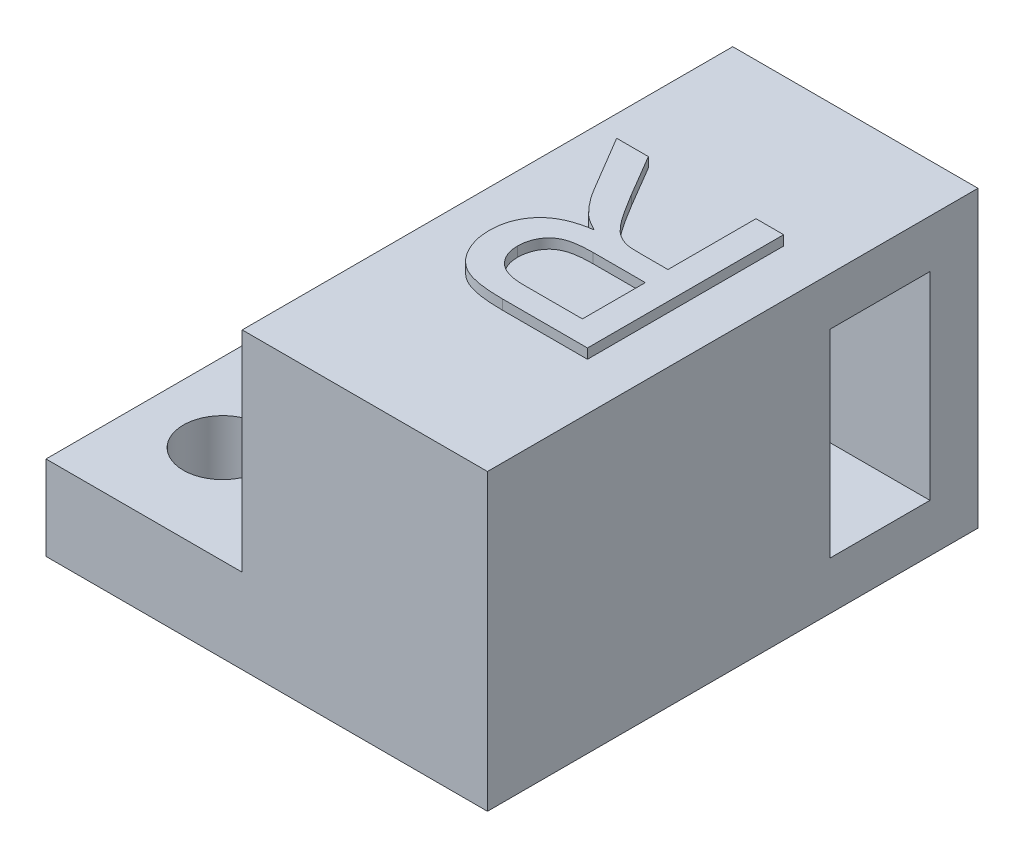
ISO-10303-21;
HEADER;
FILE_DESCRIPTION(('STEP AP214'),'2;1');
FILE_NAME('part.step','',(''),(''),'','','');
FILE_SCHEMA(('AUTOMOTIVE_DESIGN { 1 0 10303 214 1 1 1 1 }'));
ENDSEC;
DATA;
#1=APPLICATION_CONTEXT('core data for automotive mechanical design processes');
#2=APPLICATION_PROTOCOL_DEFINITION('international standard','automotive_design',2000,#1);
#3=PRODUCT_CONTEXT('',#1,'mechanical');
#4=PRODUCT('Part','Part','',(#3));
#5=PRODUCT_RELATED_PRODUCT_CATEGORY('part','',(#4));
#6=PRODUCT_DEFINITION_FORMATION('','',#4);
#7=PRODUCT_DEFINITION_CONTEXT('part definition',#1,'design');
#8=PRODUCT_DEFINITION('design','',#6,#7);
#9=PRODUCT_DEFINITION_SHAPE('','',#8);
#10=(LENGTH_UNIT() NAMED_UNIT(*) SI_UNIT(.MILLI.,.METRE.));
#11=(NAMED_UNIT(*) PLANE_ANGLE_UNIT() SI_UNIT($,.RADIAN.));
#12=(NAMED_UNIT(*) SI_UNIT($,.STERADIAN.) SOLID_ANGLE_UNIT());
#13=UNCERTAINTY_MEASURE_WITH_UNIT(LENGTH_MEASURE(1.E-05),#10,'distance_accuracy_value','');
#14=(GEOMETRIC_REPRESENTATION_CONTEXT(3) GLOBAL_UNCERTAINTY_ASSIGNED_CONTEXT((#13)) GLOBAL_UNIT_ASSIGNED_CONTEXT((#10,
#11,#12)) REPRESENTATION_CONTEXT('',''));
#15=CARTESIAN_POINT('',(0.,0.,0.));
#16=DIRECTION('',(0.,0.,1.));
#17=DIRECTION('',(1.,0.,0.));
#18=AXIS2_PLACEMENT_3D('',#15,#16,#17);
#19=CARTESIAN_POINT('',(0.,30.,0.));
#20=DIRECTION('',(0.,1.,0.));
#21=DIRECTION('',(0.,0.,1.));
#22=AXIS2_PLACEMENT_3D('',#19,#20,#21);
#23=PLANE('',#22);
#24=DIRECTION('',(1.,0.,0.));
#25=VECTOR('',#24,1.);
#26=CARTESIAN_POINT('',(4.87179487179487,30.,-9.99999999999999));
#27=LINE('',#26,#25);
#28=CARTESIAN_POINT('',(4.87179487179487,30.,-9.99999999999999));
#29=VERTEX_POINT('',#28);
#30=CARTESIAN_POINT('',(7.69230769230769,30.,-9.99999999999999));
#31=VERTEX_POINT('',#30);
#32=EDGE_CURVE('E245',#29,#31,#27,.T.);
#33=ORIENTED_EDGE('',*,*,#32,.T.);
#34=DIRECTION('',(0.,0.,1.));
#35=VECTOR('',#34,1.);
#36=CARTESIAN_POINT('',(7.69230769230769,30.,-9.99999999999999));
#37=LINE('',#36,#35);
#38=CARTESIAN_POINT('',(7.69230769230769,30.,10.));
#39=VERTEX_POINT('',#38);
#40=EDGE_CURVE('E322',#31,#39,#37,.T.);
#41=ORIENTED_EDGE('',*,*,#40,.T.);
#42=DIRECTION('',(-1.,0.,0.));
#43=VECTOR('',#42,1.);
#44=CARTESIAN_POINT('',(7.69230769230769,30.,10.));
#45=LINE('',#44,#43);
#46=CARTESIAN_POINT('',(-0.985576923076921,30.,10.));
#47=VERTEX_POINT('',#46);
#48=EDGE_CURVE('E324',#39,#47,#45,.T.);
#49=ORIENTED_EDGE('',*,*,#48,.T.);
#50=CARTESIAN_POINT('',(-0.985576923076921,30.,10.));
#51=CARTESIAN_POINT('',(-1.18991550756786,30.,9.99840651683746));
#52=CARTESIAN_POINT('',(-1.5853889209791,30.,9.99532251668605));
#53=CARTESIAN_POINT('',(-2.15889116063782,30.,9.97328498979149));
#54=CARTESIAN_POINT('',(-2.6929331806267,30.,9.92646624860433));
#55=CARTESIAN_POINT('',(-3.19088074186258,30.,9.87417544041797));
#56=CARTESIAN_POINT('',(-3.65188178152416,30.,9.79696704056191));
#57=CARTESIAN_POINT('',(-4.07615600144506,30.,9.70638766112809));
#58=CARTESIAN_POINT('',(-4.46207621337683,30.,9.59933336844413));
#59=CARTESIAN_POINT('',(-4.81257884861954,30.,9.47279075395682));
#60=CARTESIAN_POINT('',(-5.13779529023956,30.,9.32967365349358));
#61=CARTESIAN_POINT('',(-5.43916057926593,30.,9.15299269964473));
#62=CARTESIAN_POINT('',(-5.7296147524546,30.,8.95972151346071));
#63=CARTESIAN_POINT('',(-5.99757966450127,30.,8.73076560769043));
#64=CARTESIAN_POINT('',(-6.25512436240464,30.,8.48477723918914));
#65=CARTESIAN_POINT('',(-6.49146620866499,30.,8.20944831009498));
#66=CARTESIAN_POINT('',(-6.71359972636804,30.,7.91167004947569));
#67=CARTESIAN_POINT('',(-6.98368473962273,30.,7.48045766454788));
#68=CARTESIAN_POINT('',(-7.26734753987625,30.,6.90244818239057));
#69=CARTESIAN_POINT('',(-7.51167111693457,30.,6.16809301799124));
#70=CARTESIAN_POINT('',(-7.66702865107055,30.,5.39913497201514));
#71=CARTESIAN_POINT('',(-7.68379893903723,30.,4.87387389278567));
#72=CARTESIAN_POINT('',(-7.69230769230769,30.,4.6073717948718));
#73=B_SPLINE_CURVE_WITH_KNOTS('',3,(#50,#51,#52,#53,#54,#55,#56,#57,#58,#59,#60,#61,#62,#63,#64,
#65,#66,#67,#68,#69,#70,#71,#72),.UNSPECIFIED.,.F.,.F.,(4,1,1,1,1,1,1,1,1,1,1,1,1,1,1,1,1,1,1,1,
4),(0.,0.0621037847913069,0.12019460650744,0.174359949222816,0.225007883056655,
0.272315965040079,0.316339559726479,0.356815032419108,0.393918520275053,0.429524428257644,
0.464613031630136,0.4999612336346,0.535402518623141,0.571568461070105,0.608108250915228,
0.645530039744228,0.684379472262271,0.762612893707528,0.840520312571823,0.919084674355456,1.),.UNSPECIFIED.);
#74=CARTESIAN_POINT('',(-7.69230769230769,30.,4.6073717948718));
#75=VERTEX_POINT('',#74);
#76=EDGE_CURVE('E326',#47,#75,#73,.T.);
#77=ORIENTED_EDGE('',*,*,#76,.T.);
#78=CARTESIAN_POINT('',(-7.69230769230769,30.,4.6073717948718));
#79=CARTESIAN_POINT('',(-7.68839401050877,30.,4.43628861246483));
#80=CARTESIAN_POINT('',(-7.6806642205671,30.,4.0983875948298));
#81=CARTESIAN_POINT('',(-7.62145411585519,30.,3.60158210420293));
#82=CARTESIAN_POINT('',(-7.51431592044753,30.,3.12690653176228));
#83=CARTESIAN_POINT('',(-7.37693981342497,30.,2.67019394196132));
#84=CARTESIAN_POINT('',(-7.1888858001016,30.,2.23795101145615));
#85=CARTESIAN_POINT('',(-6.97113295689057,30.,1.82121588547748));
#86=CARTESIAN_POINT('',(-6.70098761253,30.,1.43193283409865));
#87=CARTESIAN_POINT('',(-6.39935585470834,30.,1.05709163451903));
#88=CARTESIAN_POINT('',(-6.04861271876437,30.,0.713608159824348));
#89=CARTESIAN_POINT('',(-5.65846741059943,30.,0.396146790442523));
#90=CARTESIAN_POINT('',(-5.21719058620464,30.,0.123711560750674));
#91=CARTESIAN_POINT('',(-4.73925532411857,30.,-0.129469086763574));
#92=CARTESIAN_POINT('',(-4.21234446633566,30.,-0.337396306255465));
#93=CARTESIAN_POINT('',(-3.64440433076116,30.,-0.52048296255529));
#94=CARTESIAN_POINT('',(-3.03103937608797,30.,-0.66164794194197));
#95=CARTESIAN_POINT('',(-2.60590699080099,30.,-0.73275428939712));
#96=CARTESIAN_POINT('',(-2.38782051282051,30.,-0.769230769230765));
#97=B_SPLINE_CURVE_WITH_KNOTS('',3,(#78,#79,#80,#81,#82,#83,#84,#85,#86,#87,#88,#89,#90,#91,#92,
#93,#94,#95,#96),.UNSPECIFIED.,.F.,.F.,(4,1,1,1,1,1,1,1,1,1,1,1,1,1,1,1,4),(0.,
0.0614153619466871,0.121299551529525,0.17923073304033,0.235946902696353,0.292227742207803,
0.348209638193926,0.404459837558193,0.462042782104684,0.520693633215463,0.580370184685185,
0.642220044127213,0.706552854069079,0.77430530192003,0.84526593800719,0.920623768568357,1.),.UNSPECIFIED.);
#98=CARTESIAN_POINT('',(-2.38782051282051,30.,-0.769230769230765));
#99=VERTEX_POINT('',#98);
#100=EDGE_CURVE('E330',#75,#99,#97,.T.);
#101=ORIENTED_EDGE('',*,*,#100,.T.);
#102=CARTESIAN_POINT('',(-2.38782051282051,30.,-0.769230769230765));
#103=CARTESIAN_POINT('',(-2.5493459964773,30.,-0.849743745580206));
#104=CARTESIAN_POINT('',(-2.85566462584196,30.,-1.00242940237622));
#105=CARTESIAN_POINT('',(-3.27249870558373,30.,-1.25505902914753));
#106=CARTESIAN_POINT('',(-3.63766389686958,30.,-1.49288820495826));
#107=CARTESIAN_POINT('',(-3.84509280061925,30.,-1.67122655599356));
#108=CARTESIAN_POINT('',(-3.94230769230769,30.,-1.75480769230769));
#109=B_SPLINE_CURVE_WITH_KNOTS('',3,(#102,#103,#104,#105,#106,#107,#108),.UNSPECIFIED.,.F.,.F.,
(4,1,1,1,4),(0.,0.293137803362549,0.555909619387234,0.791869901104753,1.),.UNSPECIFIED.);
#110=CARTESIAN_POINT('',(-3.94230769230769,30.,-1.75480769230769));
#111=VERTEX_POINT('',#110);
#112=EDGE_CURVE('E337',#99,#111,#109,.T.);
#113=ORIENTED_EDGE('',*,*,#112,.T.);
#114=CARTESIAN_POINT('',(-3.94230769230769,30.,-1.75480769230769));
#115=CARTESIAN_POINT('',(-4.13156095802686,30.,-1.93976087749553));
#116=CARTESIAN_POINT('',(-4.51968824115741,30.,-2.31906940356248));
#117=CARTESIAN_POINT('',(-5.04933861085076,30.,-2.97113456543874));
#118=CARTESIAN_POINT('',(-5.57342133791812,30.,-3.68821961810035));
#119=CARTESIAN_POINT('',(-5.88806966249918,30.,-4.21077269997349));
#120=CARTESIAN_POINT('',(-6.04967948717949,30.,-4.47916666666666));
#121=B_SPLINE_CURVE_WITH_KNOTS('',3,(#114,#115,#116,#117,#118,#119,#120),.UNSPECIFIED.,.F.,.F.,
(4,1,1,1,4),(0.,0.229542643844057,0.470754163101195,0.728168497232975,1.),.UNSPECIFIED.);
#122=CARTESIAN_POINT('',(-6.04967948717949,30.,-4.47916666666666));
#123=VERTEX_POINT('',#122);
#124=EDGE_CURVE('E344',#111,#123,#121,.T.);
#125=ORIENTED_EDGE('',*,*,#124,.T.);
#126=DIRECTION('',(-0.510913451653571,0.,-0.859632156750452));
#127=VECTOR('',#126,1.);
#128=CARTESIAN_POINT('',(-6.04967948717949,30.,-4.47916666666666));
#129=LINE('',#128,#127);
#130=CARTESIAN_POINT('',(-9.33092948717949,30.,-9.99999999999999));
#131=VERTEX_POINT('',#130);
#132=EDGE_CURVE('E351',#123,#131,#129,.T.);
#133=ORIENTED_EDGE('',*,*,#132,.T.);
#134=DIRECTION('',(1.,0.,0.));
#135=VECTOR('',#134,1.);
#136=CARTESIAN_POINT('',(-9.33092948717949,30.,-9.99999999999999));
#137=LINE('',#136,#135);
#138=CARTESIAN_POINT('',(-6.09775641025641,30.,-9.99999999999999));
#139=VERTEX_POINT('',#138);
#140=EDGE_CURVE('E356',#131,#139,#137,.T.);
#141=ORIENTED_EDGE('',*,*,#140,.T.);
#142=DIRECTION('',(0.508233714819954,0.,0.861219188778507));
#143=VECTOR('',#142,1.);
#144=CARTESIAN_POINT('',(-6.09775641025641,30.,-9.99999999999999));
#145=LINE('',#144,#143);
#146=CARTESIAN_POINT('',(-3.60576923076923,30.,-5.77724358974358));
#147=VERTEX_POINT('',#146);
#148=EDGE_CURVE('E358',#139,#147,#145,.T.);
#149=ORIENTED_EDGE('',*,*,#148,.T.);
#150=CARTESIAN_POINT('',(-3.60576923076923,30.,-5.77724358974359));
#151=CARTESIAN_POINT('',(-3.51616440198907,30.,-5.62908678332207));
#152=CARTESIAN_POINT('',(-3.34252495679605,30.,-5.34198321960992));
#153=CARTESIAN_POINT('',(-3.09179888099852,30.,-4.92262192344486));
#154=CARTESIAN_POINT('',(-2.84563940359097,30.,-4.53675178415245));
#155=CARTESIAN_POINT('',(-2.61844005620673,30.,-4.17236063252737));
#156=CARTESIAN_POINT('',(-2.39579219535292,30.,-3.83905820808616));
#157=CARTESIAN_POINT('',(-2.19620328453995,30.,-3.52423053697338));
#158=CARTESIAN_POINT('',(-1.99576395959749,30.,-3.24571275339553));
#159=CARTESIAN_POINT('',(-1.7656151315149,30.,-2.91110532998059));
#160=CARTESIAN_POINT('',(-1.48454603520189,30.,-2.54933418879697));
#161=CARTESIAN_POINT('',(-1.15655827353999,30.,-2.1776900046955));
#162=CARTESIAN_POINT('',(-0.854995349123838,30.,-1.8698364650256));
#163=CARTESIAN_POINT('',(-0.473923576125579,30.,-1.5761032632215));
#164=CARTESIAN_POINT('',(-8.08077984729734E-05,30.,-1.30716183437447));
#165=CARTESIAN_POINT('',(0.399436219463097,30.,-1.17958321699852));
#166=CARTESIAN_POINT('',(0.592948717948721,30.,-1.11778846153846));
#167=B_SPLINE_CURVE_WITH_KNOTS('',3,(#150,#151,#152,#153,#154,#155,#156,#157,#158,#159,#160,
#161,#162,#163,#164,#165,#166),.UNSPECIFIED.,.F.,.F.,(4,1,1,1,1,1,1,1,1,1,1,1,1,1,4),(0.,
0.0807565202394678,0.156492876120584,0.227864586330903,0.294219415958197,0.356757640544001,
0.414804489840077,0.468025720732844,0.516756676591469,0.604217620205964,0.681445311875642,
0.747951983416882,0.804765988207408,0.905435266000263,1.),.UNSPECIFIED.);
#168=CARTESIAN_POINT('',(0.592948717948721,30.,-1.11778846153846));
#169=VERTEX_POINT('',#168);
#170=EDGE_CURVE('E360',#147,#169,#167,.T.);
#171=ORIENTED_EDGE('',*,*,#170,.T.);
#172=CARTESIAN_POINT('',(0.592948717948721,30.,-1.11778846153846));
#173=CARTESIAN_POINT('',(0.674242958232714,30.,-1.10312834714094));
#174=CARTESIAN_POINT('',(0.859840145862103,30.,-1.06965886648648));
#175=CARTESIAN_POINT('',(1.17498370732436,30.,-1.04779989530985));
#176=CARTESIAN_POINT('',(1.5568187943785,30.,-1.02459952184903));
#177=CARTESIAN_POINT('',(1.83354118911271,30.,-1.02527550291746));
#178=CARTESIAN_POINT('',(1.98317307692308,30.,-1.02564102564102));
#179=B_SPLINE_CURVE_WITH_KNOTS('',3,(#172,#173,#174,#175,#176,#177,#178),.UNSPECIFIED.,.F.,.F.,
(4,1,1,1,4),(0.,0.177494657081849,0.405225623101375,0.678388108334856,1.),.UNSPECIFIED.);
#180=CARTESIAN_POINT('',(1.98317307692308,30.,-1.02564102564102));
#181=VERTEX_POINT('',#180);
#182=EDGE_CURVE('E364',#169,#181,#179,.T.);
#183=ORIENTED_EDGE('',*,*,#182,.T.);
#184=DIRECTION('',(1.,0.,0.));
#185=VECTOR('',#184,1.);
#186=CARTESIAN_POINT('',(1.98317307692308,30.,-1.02564102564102));
#187=LINE('',#186,#185);
#188=CARTESIAN_POINT('',(4.87179487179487,30.,-1.02564102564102));
#189=VERTEX_POINT('',#188);
#190=EDGE_CURVE('E55',#181,#189,#187,.T.);
#191=ORIENTED_EDGE('',*,*,#190,.T.);
#192=DIRECTION('',(0.,0.,-1.));
#193=VECTOR('',#192,1.);
#194=CARTESIAN_POINT('',(4.87179487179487,30.,-1.02564102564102));
#195=LINE('',#194,#193);
#196=EDGE_CURVE('E50',#189,#29,#195,.T.);
#197=ORIENTED_EDGE('',*,*,#196,.T.);
#198=EDGE_LOOP('',(#33,#41,#49,#77,#101,#113,#125,#133,#141,#149,#171,#183,#191,#197));
#199=FACE_BOUND('',#198,.T.);
#200=DIRECTION('',(0.,0.,1.));
#201=VECTOR('',#200,1.);
#202=CARTESIAN_POINT('',(-12.5,30.,25.));
#203=LINE('',#202,#201);
#204=CARTESIAN_POINT('',(-12.5,30.,-25.));
#205=VERTEX_POINT('',#204);
#206=CARTESIAN_POINT('',(-12.5,30.,25.));
#207=VERTEX_POINT('',#206);
#208=EDGE_CURVE('E480',#205,#207,#203,.T.);
#209=ORIENTED_EDGE('',*,*,#208,.T.);
#210=DIRECTION('',(1.,0.,0.));
#211=VECTOR('',#210,1.);
#212=CARTESIAN_POINT('',(12.5,30.,25.));
#213=LINE('',#212,#211);
#214=CARTESIAN_POINT('',(12.5,30.,25.));
#215=VERTEX_POINT('',#214);
#216=EDGE_CURVE('E483',#207,#215,#213,.T.);
#217=ORIENTED_EDGE('',*,*,#216,.T.);
#218=DIRECTION('',(0.,0.,-1.));
#219=VECTOR('',#218,1.);
#220=CARTESIAN_POINT('',(12.5,30.,25.));
#221=LINE('',#220,#219);
#222=CARTESIAN_POINT('',(12.5,30.,-25.));
#223=VERTEX_POINT('',#222);
#224=EDGE_CURVE('E486',#215,#223,#221,.T.);
#225=ORIENTED_EDGE('',*,*,#224,.T.);
#226=DIRECTION('',(-1.,0.,0.));
#227=VECTOR('',#226,1.);
#228=CARTESIAN_POINT('',(12.5,30.,-25.));
#229=LINE('',#228,#227);
#230=EDGE_CURVE('E488',#223,#205,#229,.T.);
#231=ORIENTED_EDGE('',*,*,#230,.T.);
#232=EDGE_LOOP('',(#209,#217,#225,#231));
#233=FACE_BOUND('',#232,.T.);
#234=ADVANCED_FACE('F35',(#199,#233),#23,.T.);
#235=CARTESIAN_POINT('',(-12.5,30.,25.));
#236=DIRECTION('',(1.,0.,0.));
#237=DIRECTION('',(0.,0.,-1.));
#238=AXIS2_PLACEMENT_3D('',#235,#236,#237);
#239=PLANE('',#238);
#240=DIRECTION('',(0.,0.,-1.));
#241=VECTOR('',#240,1.);
#242=CARTESIAN_POINT('',(-12.5,8.6050367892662,25.));
#243=LINE('',#242,#241);
#244=CARTESIAN_POINT('',(-12.5,8.6050367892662,25.));
#245=VERTEX_POINT('',#244);
#246=CARTESIAN_POINT('',(-12.5,8.6050367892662,-25.));
#247=VERTEX_POINT('',#246);
#248=EDGE_CURVE('E458',#245,#247,#243,.T.);
#249=ORIENTED_EDGE('',*,*,#248,.F.);
#250=DIRECTION('',(0.,-1.,0.));
#251=VECTOR('',#250,1.);
#252=CARTESIAN_POINT('',(-12.5,30.,25.));
#253=LINE('',#252,#251);
#254=EDGE_CURVE('E11',#207,#245,#253,.T.);
#255=ORIENTED_EDGE('',*,*,#254,.F.);
#256=ORIENTED_EDGE('',*,*,#208,.F.);
#257=DIRECTION('',(0.,-1.,0.));
#258=VECTOR('',#257,1.);
#259=CARTESIAN_POINT('',(-12.5,30.,-25.));
#260=LINE('',#259,#258);
#261=EDGE_CURVE('E490',#205,#247,#260,.T.);
#262=ORIENTED_EDGE('',*,*,#261,.T.);
#263=EDGE_LOOP('',(#249,#255,#256,#262));
#264=FACE_BOUND('',#263,.T.);
#265=ADVANCED_FACE('F37',(#264),#239,.F.);
#266=CARTESIAN_POINT('',(12.5,30.,25.));
#267=DIRECTION('',(0.,0.,-1.));
#268=DIRECTION('',(-1.,0.,0.));
#269=AXIS2_PLACEMENT_3D('',#266,#267,#268);
#270=PLANE('',#269);
#271=DIRECTION('',(1.,0.,0.));
#272=VECTOR('',#271,1.);
#273=CARTESIAN_POINT('',(12.5,0.,25.));
#274=LINE('',#273,#272);
#275=CARTESIAN_POINT('',(-32.5,0.,25.));
#276=VERTEX_POINT('',#275);
#277=CARTESIAN_POINT('',(12.5,0.,25.));
#278=VERTEX_POINT('',#277);
#279=EDGE_CURVE('E479',#276,#278,#274,.T.);
#280=ORIENTED_EDGE('',*,*,#279,.T.);
#281=DIRECTION('',(0.,-1.,0.));
#282=VECTOR('',#281,1.);
#283=CARTESIAN_POINT('',(12.5,30.,25.));
#284=LINE('',#283,#282);
#285=EDGE_CURVE('E43',#215,#278,#284,.T.);
#286=ORIENTED_EDGE('',*,*,#285,.F.);
#287=ORIENTED_EDGE('',*,*,#216,.F.);
#288=ORIENTED_EDGE('',*,*,#254,.T.);
#289=DIRECTION('',(1.,0.,0.));
#290=VECTOR('',#289,1.);
#291=CARTESIAN_POINT('',(-32.5,8.6050367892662,25.));
#292=LINE('',#291,#290);
#293=CARTESIAN_POINT('',(-32.5,8.6050367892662,25.));
#294=VERTEX_POINT('',#293);
#295=EDGE_CURVE('E476',#294,#245,#292,.T.);
#296=ORIENTED_EDGE('',*,*,#295,.F.);
#297=DIRECTION('',(0.,1.,0.));
#298=VECTOR('',#297,1.);
#299=CARTESIAN_POINT('',(-32.5,8.6050367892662,25.));
#300=LINE('',#299,#298);
#301=EDGE_CURVE('E467',#276,#294,#300,.T.);
#302=ORIENTED_EDGE('',*,*,#301,.F.);
#303=EDGE_LOOP('',(#280,#286,#287,#288,#296,#302));
#304=FACE_BOUND('',#303,.T.);
#305=ADVANCED_FACE('F518',(#304),#270,.F.);
#306=CARTESIAN_POINT('',(12.5,30.,25.));
#307=DIRECTION('',(-1.,0.,0.));
#308=DIRECTION('',(0.,0.,1.));
#309=AXIS2_PLACEMENT_3D('',#306,#307,#308);
#310=PLANE('',#309);
#311=DIRECTION('',(0.,0.,-1.));
#312=VECTOR('',#311,1.);
#313=CARTESIAN_POINT('',(12.5,4.90000000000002,-20.1));
#314=LINE('',#313,#312);
#315=CARTESIAN_POINT('',(12.5,4.90000000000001,-9.9));
#316=VERTEX_POINT('',#315);
#317=CARTESIAN_POINT('',(12.5,4.90000000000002,-20.1));
#318=VERTEX_POINT('',#317);
#319=EDGE_CURVE('E432',#316,#318,#314,.T.);
#320=ORIENTED_EDGE('',*,*,#319,.F.);
#321=DIRECTION('',(0.,-1.,0.));
#322=VECTOR('',#321,1.);
#323=CARTESIAN_POINT('',(12.5,4.90000000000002,-9.9));
#324=LINE('',#323,#322);
#325=CARTESIAN_POINT('',(12.5,25.1,-9.9));
#326=VERTEX_POINT('',#325);
#327=EDGE_CURVE('E379',#326,#316,#324,.T.);
#328=ORIENTED_EDGE('',*,*,#327,.F.);
#329=DIRECTION('',(0.,0.,1.));
#330=VECTOR('',#329,1.);
#331=CARTESIAN_POINT('',(12.5,25.1,-20.1));
#332=LINE('',#331,#330);
#333=CARTESIAN_POINT('',(12.5,25.1,-20.1));
#334=VERTEX_POINT('',#333);
#335=EDGE_CURVE('E421',#334,#326,#332,.T.);
#336=ORIENTED_EDGE('',*,*,#335,.F.);
#337=DIRECTION('',(0.,1.,0.));
#338=VECTOR('',#337,1.);
#339=CARTESIAN_POINT('',(12.5,4.90000000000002,-20.1));
#340=LINE('',#339,#338);
#341=EDGE_CURVE('E435',#318,#334,#340,.T.);
#342=ORIENTED_EDGE('',*,*,#341,.F.);
#343=EDGE_LOOP('',(#320,#328,#336,#342));
#344=FACE_BOUND('',#343,.T.);
#345=DIRECTION('',(0.,0.,-1.));
#346=VECTOR('',#345,1.);
#347=CARTESIAN_POINT('',(12.5,0.,25.));
#348=LINE('',#347,#346);
#349=CARTESIAN_POINT('',(12.5,0.,-25.));
#350=VERTEX_POINT('',#349);
#351=EDGE_CURVE('E492',#278,#350,#348,.T.);
#352=ORIENTED_EDGE('',*,*,#351,.T.);
#353=DIRECTION('',(0.,-1.,0.));
#354=VECTOR('',#353,1.);
#355=CARTESIAN_POINT('',(12.5,30.,-25.));
#356=LINE('',#355,#354);
#357=EDGE_CURVE('E496',#223,#350,#356,.T.);
#358=ORIENTED_EDGE('',*,*,#357,.F.);
#359=ORIENTED_EDGE('',*,*,#224,.F.);
#360=ORIENTED_EDGE('',*,*,#285,.T.);
#361=EDGE_LOOP('',(#352,#358,#359,#360));
#362=FACE_BOUND('',#361,.T.);
#363=ADVANCED_FACE('F503',(#344,#362),#310,.F.);
#364=CARTESIAN_POINT('',(12.5,30.,-25.));
#365=DIRECTION('',(0.,0.,1.));
#366=DIRECTION('',(1.,0.,0.));
#367=AXIS2_PLACEMENT_3D('',#364,#365,#366);
#368=PLANE('',#367);
#369=DIRECTION('',(-1.,0.,0.));
#370=VECTOR('',#369,1.);
#371=CARTESIAN_POINT('',(12.5,0.,-25.));
#372=LINE('',#371,#370);
#373=CARTESIAN_POINT('',(-32.5,0.,-25.));
#374=VERTEX_POINT('',#373);
#375=EDGE_CURVE('E484',#350,#374,#372,.T.);
#376=ORIENTED_EDGE('',*,*,#375,.T.);
#377=DIRECTION('',(0.,-1.,0.));
#378=VECTOR('',#377,1.);
#379=CARTESIAN_POINT('',(-32.5,8.6050367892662,-25.));
#380=LINE('',#379,#378);
#381=CARTESIAN_POINT('',(-32.5,8.6050367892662,-25.));
#382=VERTEX_POINT('',#381);
#383=EDGE_CURVE('E461',#382,#374,#380,.T.);
#384=ORIENTED_EDGE('',*,*,#383,.F.);
#385=DIRECTION('',(1.,0.,0.));
#386=VECTOR('',#385,1.);
#387=CARTESIAN_POINT('',(-32.5,8.6050367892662,-25.));
#388=LINE('',#387,#386);
#389=EDGE_CURVE('E471',#382,#247,#388,.T.);
#390=ORIENTED_EDGE('',*,*,#389,.T.);
#391=ORIENTED_EDGE('',*,*,#261,.F.);
#392=ORIENTED_EDGE('',*,*,#230,.F.);
#393=ORIENTED_EDGE('',*,*,#357,.T.);
#394=EDGE_LOOP('',(#376,#384,#390,#391,#392,#393));
#395=FACE_BOUND('',#394,.T.);
#396=ADVANCED_FACE('F512',(#395),#368,.F.);
#397=CARTESIAN_POINT('',(0.,0.,0.));
#398=DIRECTION('',(0.,1.,0.));
#399=DIRECTION('',(0.,0.,1.));
#400=AXIS2_PLACEMENT_3D('',#397,#398,#399);
#401=PLANE('',#400);
#402=CARTESIAN_POINT('',(-24.5,0.,15.));
#403=DIRECTION('',(0.,1.,0.));
#404=DIRECTION('',(0.,0.,1.));
#405=AXIS2_PLACEMENT_3D('',#402,#403,#404);
#406=CIRCLE('',#405,4.);
#407=CARTESIAN_POINT('',(-24.5,0.,19.));
#408=VERTEX_POINT('',#407);
#409=EDGE_CURVE('E449',#408,#408,#406,.T.);
#410=ORIENTED_EDGE('',*,*,#409,.T.);
#411=EDGE_LOOP('',(#410));
#412=FACE_BOUND('',#411,.T.);
#413=CARTESIAN_POINT('',(-24.5,0.,-15.));
#414=DIRECTION('',(0.,1.,0.));
#415=DIRECTION('',(0.,0.,1.));
#416=AXIS2_PLACEMENT_3D('',#413,#414,#415);
#417=CIRCLE('',#416,4.);
#418=CARTESIAN_POINT('',(-24.5,0.,-11.));
#419=VERTEX_POINT('',#418);
#420=EDGE_CURVE('E455',#419,#419,#417,.T.);
#421=ORIENTED_EDGE('',*,*,#420,.T.);
#422=EDGE_LOOP('',(#421));
#423=FACE_BOUND('',#422,.T.);
#424=ORIENTED_EDGE('',*,*,#279,.F.);
#425=DIRECTION('',(0.,0.,1.));
#426=VECTOR('',#425,1.);
#427=CARTESIAN_POINT('',(-32.5,0.,25.));
#428=LINE('',#427,#426);
#429=EDGE_CURVE('E464',#374,#276,#428,.T.);
#430=ORIENTED_EDGE('',*,*,#429,.F.);
#431=ORIENTED_EDGE('',*,*,#375,.F.);
#432=ORIENTED_EDGE('',*,*,#351,.F.);
#433=EDGE_LOOP('',(#424,#430,#431,#432));
#434=FACE_BOUND('',#433,.T.);
#435=ADVANCED_FACE('F508',(#412,#423,#434),#401,.F.);
#436=CARTESIAN_POINT('',(-32.5,8.6050367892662,25.));
#437=DIRECTION('',(0.,-1.,0.));
#438=DIRECTION('',(0.,0.,-1.));
#439=AXIS2_PLACEMENT_3D('',#436,#437,#438);
#440=PLANE('',#439);
#441=CARTESIAN_POINT('',(-24.5,8.6050367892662,15.));
#442=DIRECTION('',(0.,1.,0.));
#443=DIRECTION('',(0.,0.,1.));
#444=AXIS2_PLACEMENT_3D('',#441,#442,#443);
#445=CIRCLE('',#444,4.);
#446=CARTESIAN_POINT('',(-24.5,8.6050367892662,19.));
#447=VERTEX_POINT('',#446);
#448=EDGE_CURVE('E442',#447,#447,#445,.T.);
#449=ORIENTED_EDGE('',*,*,#448,.F.);
#450=EDGE_LOOP('',(#449));
#451=FACE_BOUND('',#450,.T.);
#452=CARTESIAN_POINT('',(-24.5,8.6050367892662,-15.));
#453=DIRECTION('',(0.,1.,0.));
#454=DIRECTION('',(0.,0.,1.));
#455=AXIS2_PLACEMENT_3D('',#452,#453,#454);
#456=CIRCLE('',#455,4.);
#457=CARTESIAN_POINT('',(-24.5,8.6050367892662,-11.));
#458=VERTEX_POINT('',#457);
#459=EDGE_CURVE('E452',#458,#458,#456,.T.);
#460=ORIENTED_EDGE('',*,*,#459,.F.);
#461=EDGE_LOOP('',(#460));
#462=FACE_BOUND('',#461,.T.);
#463=ORIENTED_EDGE('',*,*,#248,.T.);
#464=ORIENTED_EDGE('',*,*,#389,.F.);
#465=DIRECTION('',(0.,0.,-1.));
#466=VECTOR('',#465,1.);
#467=CARTESIAN_POINT('',(-32.5,8.6050367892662,25.));
#468=LINE('',#467,#466);
#469=EDGE_CURVE('E469',#294,#382,#468,.T.);
#470=ORIENTED_EDGE('',*,*,#469,.F.);
#471=ORIENTED_EDGE('',*,*,#295,.T.);
#472=EDGE_LOOP('',(#463,#464,#470,#471));
#473=FACE_BOUND('',#472,.T.);
#474=ADVANCED_FACE('F524',(#451,#462,#473),#440,.F.);
#475=CARTESIAN_POINT('',(-32.5,0.,0.));
#476=DIRECTION('',(1.,0.,0.));
#477=DIRECTION('',(0.,0.,-1.));
#478=AXIS2_PLACEMENT_3D('',#475,#476,#477);
#479=PLANE('',#478);
#480=ORIENTED_EDGE('',*,*,#383,.T.);
#481=ORIENTED_EDGE('',*,*,#429,.T.);
#482=ORIENTED_EDGE('',*,*,#301,.T.);
#483=ORIENTED_EDGE('',*,*,#469,.T.);
#484=EDGE_LOOP('',(#480,#481,#482,#483));
#485=FACE_BOUND('',#484,.T.);
#486=ADVANCED_FACE('F527',(#485),#479,.F.);
#487=CARTESIAN_POINT('',(-24.5,0.,-15.));
#488=DIRECTION('',(0.,1.,0.));
#489=DIRECTION('',(0.,0.,1.));
#490=AXIS2_PLACEMENT_3D('',#487,#488,#489);
#491=CYLINDRICAL_SURFACE('',#490,4.);
#492=ORIENTED_EDGE('',*,*,#420,.F.);
#493=EDGE_LOOP('',(#492));
#494=FACE_BOUND('',#493,.T.);
#495=ORIENTED_EDGE('',*,*,#459,.T.);
#496=EDGE_LOOP('',(#495));
#497=FACE_BOUND('',#496,.T.);
#498=ADVANCED_FACE('F529',(#494,#497),#491,.F.);
#499=CARTESIAN_POINT('',(-24.5,0.,15.));
#500=DIRECTION('',(0.,1.,0.));
#501=DIRECTION('',(0.,0.,1.));
#502=AXIS2_PLACEMENT_3D('',#499,#500,#501);
#503=CYLINDRICAL_SURFACE('',#502,4.);
#504=ORIENTED_EDGE('',*,*,#409,.F.);
#505=EDGE_LOOP('',(#504));
#506=FACE_BOUND('',#505,.T.);
#507=ORIENTED_EDGE('',*,*,#448,.T.);
#508=EDGE_LOOP('',(#507));
#509=FACE_BOUND('',#508,.T.);
#510=ADVANCED_FACE('F535',(#506,#509),#503,.F.);
#511=CARTESIAN_POINT('',(-7.5,4.90000000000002,-9.9));
#512=DIRECTION('',(0.,0.,1.));
#513=DIRECTION('',(1.,0.,0.));
#514=AXIS2_PLACEMENT_3D('',#511,#512,#513);
#515=PLANE('',#514);
#516=ORIENTED_EDGE('',*,*,#327,.T.);
#517=DIRECTION('',(1.,0.,0.));
#518=VECTOR('',#517,1.);
#519=CARTESIAN_POINT('',(-7.5,4.90000000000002,-9.9));
#520=LINE('',#519,#518);
#521=CARTESIAN_POINT('',(-7.5,4.90000000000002,-9.9));
#522=VERTEX_POINT('',#521);
#523=EDGE_CURVE('E430',#522,#316,#520,.T.);
#524=ORIENTED_EDGE('',*,*,#523,.F.);
#525=DIRECTION('',(0.,-1.,0.));
#526=VECTOR('',#525,1.);
#527=CARTESIAN_POINT('',(-7.5,4.90000000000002,-9.9));
#528=LINE('',#527,#526);
#529=CARTESIAN_POINT('',(-7.5,25.1,-9.9));
#530=VERTEX_POINT('',#529);
#531=EDGE_CURVE('E417',#530,#522,#528,.T.);
#532=ORIENTED_EDGE('',*,*,#531,.F.);
#533=DIRECTION('',(1.,0.,0.));
#534=VECTOR('',#533,1.);
#535=CARTESIAN_POINT('',(-7.5,25.1,-9.9));
#536=LINE('',#535,#534);
#537=EDGE_CURVE('E440',#530,#326,#536,.T.);
#538=ORIENTED_EDGE('',*,*,#537,.T.);
#539=EDGE_LOOP('',(#516,#524,#532,#538));
#540=FACE_BOUND('',#539,.T.);
#541=ADVANCED_FACE('F631',(#540),#515,.F.);
#542=CARTESIAN_POINT('',(-7.5,25.1,-20.1));
#543=DIRECTION('',(0.,1.,0.));
#544=DIRECTION('',(0.,0.,1.));
#545=AXIS2_PLACEMENT_3D('',#542,#543,#544);
#546=PLANE('',#545);
#547=ORIENTED_EDGE('',*,*,#335,.T.);
#548=ORIENTED_EDGE('',*,*,#537,.F.);
#549=DIRECTION('',(0.,0.,1.));
#550=VECTOR('',#549,1.);
#551=CARTESIAN_POINT('',(-7.5,25.1,-20.1));
#552=LINE('',#551,#550);
#553=CARTESIAN_POINT('',(-7.5,25.1,-20.1));
#554=VERTEX_POINT('',#553);
#555=EDGE_CURVE('E427',#554,#530,#552,.T.);
#556=ORIENTED_EDGE('',*,*,#555,.F.);
#557=DIRECTION('',(1.,0.,0.));
#558=VECTOR('',#557,1.);
#559=CARTESIAN_POINT('',(-7.5,25.1,-20.1));
#560=LINE('',#559,#558);
#561=EDGE_CURVE('E443',#554,#334,#560,.T.);
#562=ORIENTED_EDGE('',*,*,#561,.T.);
#563=EDGE_LOOP('',(#547,#548,#556,#562));
#564=FACE_BOUND('',#563,.T.);
#565=ADVANCED_FACE('F627',(#564),#546,.F.);
#566=CARTESIAN_POINT('',(-7.5,4.90000000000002,-20.1));
#567=DIRECTION('',(0.,0.,-1.));
#568=DIRECTION('',(-1.,0.,0.));
#569=AXIS2_PLACEMENT_3D('',#566,#567,#568);
#570=PLANE('',#569);
#571=ORIENTED_EDGE('',*,*,#341,.T.);
#572=ORIENTED_EDGE('',*,*,#561,.F.);
#573=DIRECTION('',(0.,1.,0.));
#574=VECTOR('',#573,1.);
#575=CARTESIAN_POINT('',(-7.5,4.90000000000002,-20.1));
#576=LINE('',#575,#574);
#577=CARTESIAN_POINT('',(-7.5,4.90000000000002,-20.1));
#578=VERTEX_POINT('',#577);
#579=EDGE_CURVE('E424',#578,#554,#576,.T.);
#580=ORIENTED_EDGE('',*,*,#579,.F.);
#581=DIRECTION('',(1.,0.,0.));
#582=VECTOR('',#581,1.);
#583=CARTESIAN_POINT('',(-7.5,4.90000000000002,-20.1));
#584=LINE('',#583,#582);
#585=EDGE_CURVE('E445',#578,#318,#584,.T.);
#586=ORIENTED_EDGE('',*,*,#585,.T.);
#587=EDGE_LOOP('',(#571,#572,#580,#586));
#588=FACE_BOUND('',#587,.T.);
#589=ADVANCED_FACE('F630',(#588),#570,.F.);
#590=CARTESIAN_POINT('',(-7.5,4.90000000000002,-20.1));
#591=DIRECTION('',(0.,-1.,0.));
#592=DIRECTION('',(0.,0.,-1.));
#593=AXIS2_PLACEMENT_3D('',#590,#591,#592);
#594=PLANE('',#593);
#595=ORIENTED_EDGE('',*,*,#319,.T.);
#596=ORIENTED_EDGE('',*,*,#585,.F.);
#597=DIRECTION('',(0.,0.,-1.));
#598=VECTOR('',#597,1.);
#599=CARTESIAN_POINT('',(-7.5,4.90000000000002,-20.1));
#600=LINE('',#599,#598);
#601=EDGE_CURVE('E420',#522,#578,#600,.T.);
#602=ORIENTED_EDGE('',*,*,#601,.F.);
#603=ORIENTED_EDGE('',*,*,#523,.T.);
#604=EDGE_LOOP('',(#595,#596,#602,#603));
#605=FACE_BOUND('',#604,.T.);
#606=ADVANCED_FACE('F625',(#605),#594,.F.);
#607=CARTESIAN_POINT('',(-7.5,0.,0.));
#608=DIRECTION('',(1.,0.,0.));
#609=DIRECTION('',(0.,0.,-1.));
#610=AXIS2_PLACEMENT_3D('',#607,#608,#609);
#611=PLANE('',#610);
#612=ORIENTED_EDGE('',*,*,#531,.T.);
#613=ORIENTED_EDGE('',*,*,#601,.T.);
#614=ORIENTED_EDGE('',*,*,#579,.T.);
#615=ORIENTED_EDGE('',*,*,#555,.T.);
#616=EDGE_LOOP('',(#612,#613,#614,#615));
#617=FACE_BOUND('',#616,.T.);
#618=ADVANCED_FACE('F282',(#617),#611,.T.);
#619=CARTESIAN_POINT('',(-5.72546546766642,31.,8.9540963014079));
#620=DIRECTION('',(0.,1.,-2.26830145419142E-12));
#621=DIRECTION('',(0.,2.26830145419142E-12,1.));
#622=AXIS2_PLACEMENT_3D('',#619,#620,#621);
#623=PLANE('',#622);
#624=DIRECTION('',(1.,0.,0.));
#625=VECTOR('',#624,1.);
#626=CARTESIAN_POINT('',(4.87179487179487,31.,-9.99999999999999));
#627=LINE('',#626,#625);
#628=CARTESIAN_POINT('',(4.87179487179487,31.,-9.99999999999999));
#629=VERTEX_POINT('',#628);
#630=CARTESIAN_POINT('',(7.69230769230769,31.,-9.99999999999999));
#631=VERTEX_POINT('',#630);
#632=EDGE_CURVE('E376',#629,#631,#627,.T.);
#633=ORIENTED_EDGE('',*,*,#632,.F.);
#634=DIRECTION('',(0.,0.,-1.));
#635=VECTOR('',#634,1.);
#636=CARTESIAN_POINT('',(4.87179487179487,31.,-1.02564102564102));
#637=LINE('',#636,#635);
#638=CARTESIAN_POINT('',(4.87179487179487,31.,-1.02564102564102));
#639=VERTEX_POINT('',#638);
#640=EDGE_CURVE('E317',#639,#629,#637,.T.);
#641=ORIENTED_EDGE('',*,*,#640,.F.);
#642=DIRECTION('',(1.,0.,0.));
#643=VECTOR('',#642,1.);
#644=CARTESIAN_POINT('',(1.98317307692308,31.,-1.02564102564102));
#645=LINE('',#644,#643);
#646=CARTESIAN_POINT('',(1.98317307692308,31.,-1.02564102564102));
#647=VERTEX_POINT('',#646);
#648=EDGE_CURVE('E306',#647,#639,#645,.T.);
#649=ORIENTED_EDGE('',*,*,#648,.F.);
#650=CARTESIAN_POINT('',(0.592948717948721,31.,-1.11778846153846));
#651=CARTESIAN_POINT('',(0.674242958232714,31.,-1.10312834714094));
#652=CARTESIAN_POINT('',(0.859840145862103,31.,-1.06965886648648));
#653=CARTESIAN_POINT('',(1.17498370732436,31.,-1.04779989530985));
#654=CARTESIAN_POINT('',(1.5568187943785,31.,-1.02459952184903));
#655=CARTESIAN_POINT('',(1.83354118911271,31.,-1.02527550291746));
#656=CARTESIAN_POINT('',(1.98317307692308,31.,-1.02564102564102));
#657=B_SPLINE_CURVE_WITH_KNOTS('',3,(#650,#651,#652,#653,#654,#655,#656),.UNSPECIFIED.,.F.,.F.,
(4,1,1,1,4),(0.,0.177494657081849,0.405225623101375,0.678388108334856,1.),.UNSPECIFIED.);
#658=CARTESIAN_POINT('',(0.592948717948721,31.,-1.11778846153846));
#659=VERTEX_POINT('',#658);
#660=EDGE_CURVE('E300',#659,#647,#657,.T.);
#661=ORIENTED_EDGE('',*,*,#660,.F.);
#662=CARTESIAN_POINT('',(-3.60576923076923,31.,-5.77724358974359));
#663=CARTESIAN_POINT('',(-3.51616440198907,31.,-5.62908678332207));
#664=CARTESIAN_POINT('',(-3.34252495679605,31.,-5.34198321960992));
#665=CARTESIAN_POINT('',(-3.09179888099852,31.,-4.92262192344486));
#666=CARTESIAN_POINT('',(-2.84563940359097,31.,-4.53675178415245));
#667=CARTESIAN_POINT('',(-2.61844005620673,31.,-4.17236063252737));
#668=CARTESIAN_POINT('',(-2.39579219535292,31.,-3.83905820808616));
#669=CARTESIAN_POINT('',(-2.19620328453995,31.,-3.52423053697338));
#670=CARTESIAN_POINT('',(-1.99576395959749,31.,-3.24571275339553));
#671=CARTESIAN_POINT('',(-1.7656151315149,31.,-2.91110532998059));
#672=CARTESIAN_POINT('',(-1.48454603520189,31.,-2.54933418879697));
#673=CARTESIAN_POINT('',(-1.15655827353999,31.,-2.1776900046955));
#674=CARTESIAN_POINT('',(-0.854995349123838,31.,-1.8698364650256));
#675=CARTESIAN_POINT('',(-0.473923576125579,31.,-1.5761032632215));
#676=CARTESIAN_POINT('',(-8.08077984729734E-05,31.,-1.30716183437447));
#677=CARTESIAN_POINT('',(0.399436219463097,31.,-1.17958321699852));
#678=CARTESIAN_POINT('',(0.592948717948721,31.,-1.11778846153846));
#679=B_SPLINE_CURVE_WITH_KNOTS('',3,(#662,#663,#664,#665,#666,#667,#668,#669,#670,#671,#672,
#673,#674,#675,#676,#677,#678),.UNSPECIFIED.,.F.,.F.,(4,1,1,1,1,1,1,1,1,1,1,1,1,1,4),(0.,
0.0807565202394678,0.156492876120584,0.227864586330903,0.294219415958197,0.356757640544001,
0.414804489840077,0.468025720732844,0.516756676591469,0.604217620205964,0.681445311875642,
0.747951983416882,0.804765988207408,0.905435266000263,1.),.UNSPECIFIED.);
#680=CARTESIAN_POINT('',(-3.60576923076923,31.,-5.77724358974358));
#681=VERTEX_POINT('',#680);
#682=EDGE_CURVE('E307',#681,#659,#679,.T.);
#683=ORIENTED_EDGE('',*,*,#682,.F.);
#684=DIRECTION('',(0.508233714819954,0.,0.861219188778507));
#685=VECTOR('',#684,1.);
#686=CARTESIAN_POINT('',(-6.09775641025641,31.,-9.99999999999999));
#687=LINE('',#686,#685);
#688=CARTESIAN_POINT('',(-6.09775641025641,31.,-9.99999999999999));
#689=VERTEX_POINT('',#688);
#690=EDGE_CURVE('E929',#689,#681,#687,.T.);
#691=ORIENTED_EDGE('',*,*,#690,.F.);
#692=DIRECTION('',(1.,0.,0.));
#693=VECTOR('',#692,1.);
#694=CARTESIAN_POINT('',(-9.33092948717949,31.,-9.99999999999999));
#695=LINE('',#694,#693);
#696=CARTESIAN_POINT('',(-9.33092948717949,31.,-9.99999999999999));
#697=VERTEX_POINT('',#696);
#698=EDGE_CURVE('E930',#697,#689,#695,.T.);
#699=ORIENTED_EDGE('',*,*,#698,.F.);
#700=DIRECTION('',(-0.510913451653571,0.,-0.859632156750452));
#701=VECTOR('',#700,1.);
#702=CARTESIAN_POINT('',(-6.04967948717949,31.,-4.47916666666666));
#703=LINE('',#702,#701);
#704=CARTESIAN_POINT('',(-6.04967948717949,31.,-4.47916666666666));
#705=VERTEX_POINT('',#704);
#706=EDGE_CURVE('E932',#705,#697,#703,.T.);
#707=ORIENTED_EDGE('',*,*,#706,.F.);
#708=CARTESIAN_POINT('',(-3.94230769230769,31.,-1.75480769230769));
#709=CARTESIAN_POINT('',(-4.13156095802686,31.,-1.93976087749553));
#710=CARTESIAN_POINT('',(-4.51968824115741,31.,-2.31906940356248));
#711=CARTESIAN_POINT('',(-5.04933861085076,31.,-2.97113456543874));
#712=CARTESIAN_POINT('',(-5.57342133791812,31.,-3.68821961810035));
#713=CARTESIAN_POINT('',(-5.88806966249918,31.,-4.21077269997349));
#714=CARTESIAN_POINT('',(-6.04967948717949,31.,-4.47916666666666));
#715=B_SPLINE_CURVE_WITH_KNOTS('',3,(#708,#709,#710,#711,#712,#713,#714),.UNSPECIFIED.,.F.,.F.,
(4,1,1,1,4),(0.,0.229542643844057,0.470754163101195,0.728168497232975,1.),.UNSPECIFIED.);
#716=CARTESIAN_POINT('',(-3.94230769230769,31.,-1.75480769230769));
#717=VERTEX_POINT('',#716);
#718=EDGE_CURVE('E937',#717,#705,#715,.T.);
#719=ORIENTED_EDGE('',*,*,#718,.F.);
#720=CARTESIAN_POINT('',(-2.38782051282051,31.,-0.769230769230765));
#721=CARTESIAN_POINT('',(-2.5493459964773,31.,-0.849743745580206));
#722=CARTESIAN_POINT('',(-2.85566462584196,31.,-1.00242940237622));
#723=CARTESIAN_POINT('',(-3.27249870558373,31.,-1.25505902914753));
#724=CARTESIAN_POINT('',(-3.63766389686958,31.,-1.49288820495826));
#725=CARTESIAN_POINT('',(-3.84509280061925,31.,-1.67122655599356));
#726=CARTESIAN_POINT('',(-3.94230769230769,31.,-1.75480769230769));
#727=B_SPLINE_CURVE_WITH_KNOTS('',3,(#720,#721,#722,#723,#724,#725,#726),.UNSPECIFIED.,.F.,.F.,
(4,1,1,1,4),(0.,0.293137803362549,0.555909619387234,0.791869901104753,1.),.UNSPECIFIED.);
#728=CARTESIAN_POINT('',(-2.38782051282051,31.,-0.769230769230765));
#729=VERTEX_POINT('',#728);
#730=EDGE_CURVE('E942',#729,#717,#727,.T.);
#731=ORIENTED_EDGE('',*,*,#730,.F.);
#732=CARTESIAN_POINT('',(-7.69230769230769,31.,4.6073717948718));
#733=CARTESIAN_POINT('',(-7.68839401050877,31.,4.43628861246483));
#734=CARTESIAN_POINT('',(-7.6806642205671,31.,4.0983875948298));
#735=CARTESIAN_POINT('',(-7.62145411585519,31.,3.60158210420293));
#736=CARTESIAN_POINT('',(-7.51431592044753,31.,3.12690653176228));
#737=CARTESIAN_POINT('',(-7.37693981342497,31.,2.67019394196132));
#738=CARTESIAN_POINT('',(-7.1888858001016,31.,2.23795101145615));
#739=CARTESIAN_POINT('',(-6.97113295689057,31.,1.82121588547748));
#740=CARTESIAN_POINT('',(-6.70098761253,31.,1.43193283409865));
#741=CARTESIAN_POINT('',(-6.39935585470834,31.,1.05709163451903));
#742=CARTESIAN_POINT('',(-6.04861271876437,31.,0.713608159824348));
#743=CARTESIAN_POINT('',(-5.65846741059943,31.,0.396146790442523));
#744=CARTESIAN_POINT('',(-5.21719058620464,31.,0.123711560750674));
#745=CARTESIAN_POINT('',(-4.73925532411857,31.,-0.129469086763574));
#746=CARTESIAN_POINT('',(-4.21234446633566,31.,-0.337396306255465));
#747=CARTESIAN_POINT('',(-3.64440433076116,31.,-0.52048296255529));
#748=CARTESIAN_POINT('',(-3.03103937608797,31.,-0.66164794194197));
#749=CARTESIAN_POINT('',(-2.60590699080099,31.,-0.73275428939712));
#750=CARTESIAN_POINT('',(-2.38782051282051,31.,-0.769230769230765));
#751=B_SPLINE_CURVE_WITH_KNOTS('',3,(#732,#733,#734,#735,#736,#737,#738,#739,#740,#741,#742,
#743,#744,#745,#746,#747,#748,#749,#750),.UNSPECIFIED.,.F.,.F.,(4,1,1,1,1,1,1,1,1,1,1,1,1,1,1,1,
4),(0.,0.0614153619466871,0.121299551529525,0.17923073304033,0.235946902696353,
0.292227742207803,0.348209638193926,0.404459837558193,0.462042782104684,0.520693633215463,
0.580370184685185,0.642220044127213,0.706552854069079,0.77430530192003,0.84526593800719,
0.920623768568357,1.),.UNSPECIFIED.);
#752=CARTESIAN_POINT('',(-7.69230769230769,31.,4.6073717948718));
#753=VERTEX_POINT('',#752);
#754=EDGE_CURVE('E597',#753,#729,#751,.T.);
#755=ORIENTED_EDGE('',*,*,#754,.F.);
#756=CARTESIAN_POINT('',(-0.985576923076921,31.,10.));
#757=CARTESIAN_POINT('',(-1.18991550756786,31.,9.99840651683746));
#758=CARTESIAN_POINT('',(-1.5853889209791,31.,9.99532251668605));
#759=CARTESIAN_POINT('',(-2.15889116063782,31.,9.97328498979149));
#760=CARTESIAN_POINT('',(-2.6929331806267,31.,9.92646624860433));
#761=CARTESIAN_POINT('',(-3.19088074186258,31.,9.87417544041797));
#762=CARTESIAN_POINT('',(-3.65188178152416,31.,9.79696704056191));
#763=CARTESIAN_POINT('',(-4.07615600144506,31.,9.70638766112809));
#764=CARTESIAN_POINT('',(-4.46207621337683,31.,9.59933336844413));
#765=CARTESIAN_POINT('',(-4.81257884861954,31.,9.47279075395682));
#766=CARTESIAN_POINT('',(-5.13779529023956,31.,9.32967365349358));
#767=CARTESIAN_POINT('',(-5.43916057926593,31.,9.15299269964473));
#768=CARTESIAN_POINT('',(-5.7296147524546,31.,8.95972151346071));
#769=CARTESIAN_POINT('',(-5.99757966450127,31.,8.73076560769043));
#770=CARTESIAN_POINT('',(-6.25512436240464,31.,8.48477723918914));
#771=CARTESIAN_POINT('',(-6.49146620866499,31.,8.20944831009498));
#772=CARTESIAN_POINT('',(-6.71359972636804,31.,7.91167004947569));
#773=CARTESIAN_POINT('',(-6.98368473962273,31.,7.48045766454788));
#774=CARTESIAN_POINT('',(-7.26734753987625,31.,6.90244818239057));
#775=CARTESIAN_POINT('',(-7.51167111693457,31.,6.16809301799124));
#776=CARTESIAN_POINT('',(-7.66702865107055,31.,5.39913497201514));
#777=CARTESIAN_POINT('',(-7.68379893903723,31.,4.87387389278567));
#778=CARTESIAN_POINT('',(-7.69230769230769,31.,4.6073717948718));
#779=B_SPLINE_CURVE_WITH_KNOTS('',3,(#756,#757,#758,#759,#760,#761,#762,#763,#764,#765,#766,
#767,#768,#769,#770,#771,#772,#773,#774,#775,#776,#777,#778),.UNSPECIFIED.,.F.,.F.,(4,1,1,1,1,1,
1,1,1,1,1,1,1,1,1,1,1,1,1,1,4),(0.,0.0621037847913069,0.12019460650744,0.174359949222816,
0.225007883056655,0.272315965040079,0.316339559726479,0.356815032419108,0.393918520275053,
0.429524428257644,0.464613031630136,0.4999612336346,0.535402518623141,0.571568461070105,
0.608108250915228,0.645530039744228,0.684379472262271,0.762612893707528,0.840520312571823,
0.919084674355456,1.),.UNSPECIFIED.);
#780=CARTESIAN_POINT('',(-0.985576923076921,31.,10.));
#781=VERTEX_POINT('',#780);
#782=EDGE_CURVE('E591',#781,#753,#779,.T.);
#783=ORIENTED_EDGE('',*,*,#782,.F.);
#784=DIRECTION('',(-1.,0.,0.));
#785=VECTOR('',#784,1.);
#786=CARTESIAN_POINT('',(7.69230769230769,31.,10.));
#787=LINE('',#786,#785);
#788=CARTESIAN_POINT('',(7.69230769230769,31.,10.));
#789=VERTEX_POINT('',#788);
#790=EDGE_CURVE('E588',#789,#781,#787,.T.);
#791=ORIENTED_EDGE('',*,*,#790,.F.);
#792=DIRECTION('',(0.,0.,1.));
#793=VECTOR('',#792,1.);
#794=CARTESIAN_POINT('',(7.69230769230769,31.,-9.99999999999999));
#795=LINE('',#794,#793);
#796=EDGE_CURVE('E585',#631,#789,#795,.T.);
#797=ORIENTED_EDGE('',*,*,#796,.F.);
#798=EDGE_LOOP('',(#633,#641,#649,#661,#683,#691,#699,#707,#719,#731,#755,#783,#791,#797));
#799=FACE_BOUND('',#798,.T.);
#800=DIRECTION('',(-1.,0.,0.));
#801=VECTOR('',#800,1.);
#802=CARTESIAN_POINT('',(4.87179487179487,31.,1.28205128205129));
#803=LINE('',#802,#801);
#804=CARTESIAN_POINT('',(4.87179487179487,31.,1.28205128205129));
#805=VERTEX_POINT('',#804);
#806=CARTESIAN_POINT('',(-0.484775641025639,31.,1.28205128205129));
#807=VERTEX_POINT('',#806);
#808=EDGE_CURVE('E236',#805,#807,#803,.T.);
#809=ORIENTED_EDGE('',*,*,#808,.F.);
#810=DIRECTION('',(0.,0.,-1.));
#811=VECTOR('',#810,1.);
#812=CARTESIAN_POINT('',(4.87179487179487,31.,7.6923076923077));
#813=LINE('',#812,#811);
#814=CARTESIAN_POINT('',(4.87179487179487,31.,7.6923076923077));
#815=VERTEX_POINT('',#814);
#816=EDGE_CURVE('E226',#815,#805,#813,.T.);
#817=ORIENTED_EDGE('',*,*,#816,.F.);
#818=DIRECTION('',(1.,0.,0.));
#819=VECTOR('',#818,1.);
#820=CARTESIAN_POINT('',(-1.08974358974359,31.,7.6923076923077));
#821=LINE('',#820,#819);
#822=CARTESIAN_POINT('',(-1.08974358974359,30.9999999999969,7.6923076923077));
#823=VERTEX_POINT('',#822);
#824=EDGE_CURVE('E559',#823,#815,#821,.T.);
#825=ORIENTED_EDGE('',*,*,#824,.F.);
#826=CARTESIAN_POINT('',(-4.87179487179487,31.,4.54727564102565));
#827=CARTESIAN_POINT('',(-4.8680889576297,31.,4.65954476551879));
#828=CARTESIAN_POINT('',(-4.86083016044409,31.,4.87944699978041));
#829=CARTESIAN_POINT('',(-4.82237214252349,31.,5.2020971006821));
#830=CARTESIAN_POINT('',(-4.74920242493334,31.,5.50786025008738));
#831=CARTESIAN_POINT('',(-4.64816500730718,31.,5.79894054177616));
#832=CARTESIAN_POINT('',(-4.5202368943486,31.,6.07596995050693));
#833=CARTESIAN_POINT('',(-4.36303348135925,31.,6.33785890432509));
#834=CARTESIAN_POINT('',(-4.17736592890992,31.,6.5832697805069));
#835=CARTESIAN_POINT('',(-3.96438347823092,31.,6.81341074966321));
#836=CARTESIAN_POINT('',(-3.71992686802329,31.,7.02284832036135));
#837=CARTESIAN_POINT('',(-3.44067606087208,31.,7.20353899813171));
#838=CARTESIAN_POINT('',(-3.1288609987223,31.,7.35708946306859));
#839=CARTESIAN_POINT('',(-2.78411146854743,31.,7.47895673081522));
#840=CARTESIAN_POINT('',(-2.40751572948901,31.,7.57643089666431));
#841=CARTESIAN_POINT('',(-1.99692925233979,31.,7.64127726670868));
#842=CARTESIAN_POINT('',(-1.55422992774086,31.,7.68819989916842));
#843=CARTESIAN_POINT('',(-1.24746496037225,31.,7.69091284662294));
#844=CARTESIAN_POINT('',(-1.08974358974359,31.,7.6923076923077));
#845=B_SPLINE_CURVE_WITH_KNOTS('',3,(#826,#827,#828,#829,#830,#831,#832,#833,#834,#835,#836,
#837,#838,#839,#840,#841,#842,#843,#844),.UNSPECIFIED.,.F.,.F.,(4,1,1,1,1,1,1,1,1,1,1,1,1,1,1,1,
4),(0.,0.0603272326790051,0.118163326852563,0.174191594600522,0.228867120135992,
0.283429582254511,0.33780781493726,0.392614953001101,0.448450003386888,0.505951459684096,
0.565046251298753,0.626643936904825,0.692223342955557,0.76112433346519,0.835305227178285,
0.915323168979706,1.),.UNSPECIFIED.);
#846=CARTESIAN_POINT('',(-4.87179487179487,31.,4.54727564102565));
#847=VERTEX_POINT('',#846);
#848=EDGE_CURVE('E253',#847,#823,#845,.T.);
#849=ORIENTED_EDGE('',*,*,#848,.F.);
#850=CARTESIAN_POINT('',(-0.484775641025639,31.,1.28205128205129));
#851=CARTESIAN_POINT('',(-0.753386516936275,31.,1.28621741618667));
#852=CARTESIAN_POINT('',(-1.25552935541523,31.,1.2940056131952));
#853=CARTESIAN_POINT('',(-1.95751817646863,31.,1.36152824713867));
#854=CARTESIAN_POINT('',(-2.55800039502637,31.,1.46707580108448));
#855=CARTESIAN_POINT('',(-3.06464629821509,31.,1.62738475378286));
#856=CARTESIAN_POINT('',(-3.49043278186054,31.,1.84207007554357));
#857=CARTESIAN_POINT('',(-3.85946292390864,31.,2.104609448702));
#858=CARTESIAN_POINT('',(-4.16975282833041,31.,2.43032134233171));
#859=CARTESIAN_POINT('',(-4.42493947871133,31.,2.80379836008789));
#860=CARTESIAN_POINT('',(-4.62442579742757,31.,3.21081083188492));
#861=CARTESIAN_POINT('',(-4.76381672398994,31.,3.6415835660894));
#862=CARTESIAN_POINT('',(-4.85739890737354,31.,4.08785628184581));
#863=CARTESIAN_POINT('',(-4.86696753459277,31.,4.39322051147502));
#864=CARTESIAN_POINT('',(-4.87179487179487,31.,4.54727564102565));
#865=B_SPLINE_CURVE_WITH_KNOTS('',3,(#850,#851,#852,#853,#854,#855,#856,#857,#858,#859,#860,
#861,#862,#863,#864),.UNSPECIFIED.,.F.,.F.,(4,1,1,1,1,1,1,1,1,1,1,1,4),(0.,0.128838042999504,
0.240850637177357,0.337985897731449,0.420854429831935,0.494779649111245,0.565908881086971,
0.637049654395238,0.709380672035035,0.782161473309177,0.853682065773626,0.926183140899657,1.),.UNSPECIFIED.);
#866=EDGE_CURVE('E251',#807,#847,#865,.T.);
#867=ORIENTED_EDGE('',*,*,#866,.F.);
#868=EDGE_LOOP('',(#809,#817,#825,#849,#867));
#869=FACE_BOUND('',#868,.T.);
#870=ADVANCED_FACE('F249',(#799,#869),#623,.T.);
#871=CARTESIAN_POINT('',(4.87179487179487,31.,-9.99999999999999));
#872=DIRECTION('',(0.,0.,-1.));
#873=DIRECTION('',(-1.,0.,0.));
#874=AXIS2_PLACEMENT_3D('',#871,#872,#873);
#875=PLANE('',#874);
#876=ORIENTED_EDGE('',*,*,#32,.F.);
#877=DIRECTION('',(0.,-1.,0.));
#878=VECTOR('',#877,1.);
#879=CARTESIAN_POINT('',(4.87179487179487,31.,-9.99999999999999));
#880=LINE('',#879,#878);
#881=EDGE_CURVE('E377',#629,#29,#880,.T.);
#882=ORIENTED_EDGE('',*,*,#881,.F.);
#883=ORIENTED_EDGE('',*,*,#632,.T.);
#884=DIRECTION('',(0.,-1.,0.));
#885=VECTOR('',#884,1.);
#886=CARTESIAN_POINT('',(7.69230769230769,31.,-9.99999999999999));
#887=LINE('',#886,#885);
#888=EDGE_CURVE('E320',#631,#31,#887,.T.);
#889=ORIENTED_EDGE('',*,*,#888,.T.);
#890=EDGE_LOOP('',(#876,#882,#883,#889));
#891=FACE_BOUND('',#890,.T.);
#892=ADVANCED_FACE('F281',(#891),#875,.T.);
#893=CARTESIAN_POINT('',(4.87179487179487,31.,-1.02564102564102));
#894=DIRECTION('',(-1.,0.,0.));
#895=DIRECTION('',(0.,0.,1.));
#896=AXIS2_PLACEMENT_3D('',#893,#894,#895);
#897=PLANE('',#896);
#898=ORIENTED_EDGE('',*,*,#196,.F.);
#899=DIRECTION('',(0.,-1.,0.));
#900=VECTOR('',#899,1.);
#901=CARTESIAN_POINT('',(4.87179487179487,31.,-1.02564102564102));
#902=LINE('',#901,#900);
#903=EDGE_CURVE('E380',#639,#189,#902,.T.);
#904=ORIENTED_EDGE('',*,*,#903,.F.);
#905=ORIENTED_EDGE('',*,*,#640,.T.);
#906=ORIENTED_EDGE('',*,*,#881,.T.);
#907=EDGE_LOOP('',(#898,#904,#905,#906));
#908=FACE_BOUND('',#907,.T.);
#909=ADVANCED_FACE('F284',(#908),#897,.T.);
#910=CARTESIAN_POINT('',(1.98317307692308,31.,-1.02564102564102));
#911=DIRECTION('',(0.,0.,-1.));
#912=DIRECTION('',(-1.,0.,0.));
#913=AXIS2_PLACEMENT_3D('',#910,#911,#912);
#914=PLANE('',#913);
#915=ORIENTED_EDGE('',*,*,#190,.F.);
#916=DIRECTION('',(0.,-1.,0.));
#917=VECTOR('',#916,1.);
#918=CARTESIAN_POINT('',(1.98317307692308,31.,-1.02564102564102));
#919=LINE('',#918,#917);
#920=EDGE_CURVE('E382',#647,#181,#919,.T.);
#921=ORIENTED_EDGE('',*,*,#920,.F.);
#922=ORIENTED_EDGE('',*,*,#648,.T.);
#923=ORIENTED_EDGE('',*,*,#903,.T.);
#924=EDGE_LOOP('',(#915,#921,#922,#923));
#925=FACE_BOUND('',#924,.T.);
#926=ADVANCED_FACE('F287',(#925),#914,.T.);
#927=DIRECTION('',(0.,-1.,0.));
#928=VECTOR('',#927,1.);
#929=SURFACE_OF_LINEAR_EXTRUSION('',#657,#928);
#930=ORIENTED_EDGE('',*,*,#182,.F.);
#931=DIRECTION('',(0.,-1.,0.));
#932=VECTOR('',#931,1.);
#933=CARTESIAN_POINT('',(0.592948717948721,31.,-1.11778846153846));
#934=LINE('',#933,#932);
#935=EDGE_CURVE('E385',#659,#169,#934,.T.);
#936=ORIENTED_EDGE('',*,*,#935,.F.);
#937=ORIENTED_EDGE('',*,*,#660,.T.);
#938=ORIENTED_EDGE('',*,*,#920,.T.);
#939=EDGE_LOOP('',(#930,#936,#937,#938));
#940=FACE_BOUND('',#939,.T.);
#941=ADVANCED_FACE('F291',(#940),#929,.T.);
#942=DIRECTION('',(0.,-1.,0.));
#943=VECTOR('',#942,1.);
#944=SURFACE_OF_LINEAR_EXTRUSION('',#679,#943);
#945=ORIENTED_EDGE('',*,*,#170,.F.);
#946=DIRECTION('',(0.,-1.,0.));
#947=VECTOR('',#946,1.);
#948=CARTESIAN_POINT('',(-3.60576923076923,31.,-5.77724358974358));
#949=LINE('',#948,#947);
#950=EDGE_CURVE('E388',#681,#147,#949,.T.);
#951=ORIENTED_EDGE('',*,*,#950,.F.);
#952=ORIENTED_EDGE('',*,*,#682,.T.);
#953=ORIENTED_EDGE('',*,*,#935,.T.);
#954=EDGE_LOOP('',(#945,#951,#952,#953));
#955=FACE_BOUND('',#954,.T.);
#956=ADVANCED_FACE('F296',(#955),#944,.T.);
#957=CARTESIAN_POINT('',(-6.09775641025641,31.,-9.99999999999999));
#958=DIRECTION('',(0.861219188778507,0.,-0.508233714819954));
#959=DIRECTION('',(-0.508233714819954,0.,-0.861219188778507));
#960=AXIS2_PLACEMENT_3D('',#957,#958,#959);
#961=PLANE('',#960);
#962=ORIENTED_EDGE('',*,*,#148,.F.);
#963=DIRECTION('',(0.,-1.,0.));
#964=VECTOR('',#963,1.);
#965=CARTESIAN_POINT('',(-6.09775641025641,31.,-9.99999999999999));
#966=LINE('',#965,#964);
#967=EDGE_CURVE('E391',#689,#139,#966,.T.);
#968=ORIENTED_EDGE('',*,*,#967,.F.);
#969=ORIENTED_EDGE('',*,*,#690,.T.);
#970=ORIENTED_EDGE('',*,*,#950,.T.);
#971=EDGE_LOOP('',(#962,#968,#969,#970));
#972=FACE_BOUND('',#971,.T.);
#973=ADVANCED_FACE('F766',(#972),#961,.T.);
#974=CARTESIAN_POINT('',(-9.33092948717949,31.,-9.99999999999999));
#975=DIRECTION('',(0.,0.,-1.));
#976=DIRECTION('',(-1.,0.,0.));
#977=AXIS2_PLACEMENT_3D('',#974,#975,#976);
#978=PLANE('',#977);
#979=ORIENTED_EDGE('',*,*,#140,.F.);
#980=DIRECTION('',(0.,-1.,0.));
#981=VECTOR('',#980,1.);
#982=CARTESIAN_POINT('',(-9.33092948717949,31.,-9.99999999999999));
#983=LINE('',#982,#981);
#984=EDGE_CURVE('E394',#697,#131,#983,.T.);
#985=ORIENTED_EDGE('',*,*,#984,.F.);
#986=ORIENTED_EDGE('',*,*,#698,.T.);
#987=ORIENTED_EDGE('',*,*,#967,.T.);
#988=EDGE_LOOP('',(#979,#985,#986,#987));
#989=FACE_BOUND('',#988,.T.);
#990=ADVANCED_FACE('F774',(#989),#978,.T.);
#991=CARTESIAN_POINT('',(-6.04967948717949,31.,-4.47916666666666));
#992=DIRECTION('',(-0.859632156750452,0.,0.510913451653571));
#993=DIRECTION('',(0.510913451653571,0.,0.859632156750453));
#994=AXIS2_PLACEMENT_3D('',#991,#992,#993);
#995=PLANE('',#994);
#996=ORIENTED_EDGE('',*,*,#132,.F.);
#997=DIRECTION('',(0.,-1.,0.));
#998=VECTOR('',#997,1.);
#999=CARTESIAN_POINT('',(-6.04967948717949,31.,-4.47916666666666));
#1000=LINE('',#999,#998);
#1001=EDGE_CURVE('E397',#705,#123,#1000,.T.);
#1002=ORIENTED_EDGE('',*,*,#1001,.F.);
#1003=ORIENTED_EDGE('',*,*,#706,.T.);
#1004=ORIENTED_EDGE('',*,*,#984,.T.);
#1005=EDGE_LOOP('',(#996,#1002,#1003,#1004));
#1006=FACE_BOUND('',#1005,.T.);
#1007=ADVANCED_FACE('F782',(#1006),#995,.T.);
#1008=DIRECTION('',(0.,-1.,0.));
#1009=VECTOR('',#1008,1.);
#1010=SURFACE_OF_LINEAR_EXTRUSION('',#715,#1009);
#1011=ORIENTED_EDGE('',*,*,#124,.F.);
#1012=DIRECTION('',(0.,-1.,0.));
#1013=VECTOR('',#1012,1.);
#1014=CARTESIAN_POINT('',(-3.94230769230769,31.,-1.75480769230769));
#1015=LINE('',#1014,#1013);
#1016=EDGE_CURVE('E400',#717,#111,#1015,.T.);
#1017=ORIENTED_EDGE('',*,*,#1016,.F.);
#1018=ORIENTED_EDGE('',*,*,#718,.T.);
#1019=ORIENTED_EDGE('',*,*,#1001,.T.);
#1020=EDGE_LOOP('',(#1011,#1017,#1018,#1019));
#1021=FACE_BOUND('',#1020,.T.);
#1022=ADVANCED_FACE('F791',(#1021),#1010,.T.);
#1023=DIRECTION('',(0.,-1.,0.));
#1024=VECTOR('',#1023,1.);
#1025=SURFACE_OF_LINEAR_EXTRUSION('',#727,#1024);
#1026=ORIENTED_EDGE('',*,*,#112,.F.);
#1027=DIRECTION('',(0.,-1.,0.));
#1028=VECTOR('',#1027,1.);
#1029=CARTESIAN_POINT('',(-2.38782051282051,31.,-0.769230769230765));
#1030=LINE('',#1029,#1028);
#1031=EDGE_CURVE('E403',#729,#99,#1030,.T.);
#1032=ORIENTED_EDGE('',*,*,#1031,.F.);
#1033=ORIENTED_EDGE('',*,*,#730,.T.);
#1034=ORIENTED_EDGE('',*,*,#1016,.T.);
#1035=EDGE_LOOP('',(#1026,#1032,#1033,#1034));
#1036=FACE_BOUND('',#1035,.T.);
#1037=ADVANCED_FACE('F800',(#1036),#1025,.T.);
#1038=DIRECTION('',(0.,-1.,0.));
#1039=VECTOR('',#1038,1.);
#1040=SURFACE_OF_LINEAR_EXTRUSION('',#751,#1039);
#1041=ORIENTED_EDGE('',*,*,#100,.F.);
#1042=DIRECTION('',(0.,-1.,0.));
#1043=VECTOR('',#1042,1.);
#1044=CARTESIAN_POINT('',(-7.69230769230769,31.,4.6073717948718));
#1045=LINE('',#1044,#1043);
#1046=EDGE_CURVE('E406',#753,#75,#1045,.T.);
#1047=ORIENTED_EDGE('',*,*,#1046,.F.);
#1048=ORIENTED_EDGE('',*,*,#754,.T.);
#1049=ORIENTED_EDGE('',*,*,#1031,.T.);
#1050=EDGE_LOOP('',(#1041,#1047,#1048,#1049));
#1051=FACE_BOUND('',#1050,.T.);
#1052=ADVANCED_FACE('F611',(#1051),#1040,.T.);
#1053=DIRECTION('',(0.,-1.,0.));
#1054=VECTOR('',#1053,1.);
#1055=SURFACE_OF_LINEAR_EXTRUSION('',#779,#1054);
#1056=ORIENTED_EDGE('',*,*,#76,.F.);
#1057=DIRECTION('',(0.,-1.,0.));
#1058=VECTOR('',#1057,1.);
#1059=CARTESIAN_POINT('',(-0.985576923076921,31.,10.));
#1060=LINE('',#1059,#1058);
#1061=EDGE_CURVE('E409',#781,#47,#1060,.T.);
#1062=ORIENTED_EDGE('',*,*,#1061,.F.);
#1063=ORIENTED_EDGE('',*,*,#782,.T.);
#1064=ORIENTED_EDGE('',*,*,#1046,.T.);
#1065=EDGE_LOOP('',(#1056,#1062,#1063,#1064));
#1066=FACE_BOUND('',#1065,.T.);
#1067=ADVANCED_FACE('F606',(#1066),#1055,.T.);
#1068=CARTESIAN_POINT('',(7.69230769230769,31.,10.));
#1069=DIRECTION('',(0.,0.,1.));
#1070=DIRECTION('',(1.,0.,0.));
#1071=AXIS2_PLACEMENT_3D('',#1068,#1069,#1070);
#1072=PLANE('',#1071);
#1073=ORIENTED_EDGE('',*,*,#48,.F.);
#1074=DIRECTION('',(0.,-1.,0.));
#1075=VECTOR('',#1074,1.);
#1076=CARTESIAN_POINT('',(7.69230769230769,31.,10.));
#1077=LINE('',#1076,#1075);
#1078=EDGE_CURVE('E412',#789,#39,#1077,.T.);
#1079=ORIENTED_EDGE('',*,*,#1078,.F.);
#1080=ORIENTED_EDGE('',*,*,#790,.T.);
#1081=ORIENTED_EDGE('',*,*,#1061,.T.);
#1082=EDGE_LOOP('',(#1073,#1079,#1080,#1081));
#1083=FACE_BOUND('',#1082,.T.);
#1084=ADVANCED_FACE('F610',(#1083),#1072,.T.);
#1085=CARTESIAN_POINT('',(7.69230769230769,31.,-9.99999999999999));
#1086=DIRECTION('',(1.,0.,0.));
#1087=DIRECTION('',(0.,0.,-1.));
#1088=AXIS2_PLACEMENT_3D('',#1085,#1086,#1087);
#1089=PLANE('',#1088);
#1090=ORIENTED_EDGE('',*,*,#40,.F.);
#1091=ORIENTED_EDGE('',*,*,#888,.F.);
#1092=ORIENTED_EDGE('',*,*,#796,.T.);
#1093=ORIENTED_EDGE('',*,*,#1078,.T.);
#1094=EDGE_LOOP('',(#1090,#1091,#1092,#1093));
#1095=FACE_BOUND('',#1094,.T.);
#1096=ADVANCED_FACE('F278',(#1095),#1089,.T.);
#1097=CARTESIAN_POINT('',(4.87179487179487,31.,7.6923076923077));
#1098=DIRECTION('',(-1.,0.,0.));
#1099=DIRECTION('',(0.,0.,1.));
#1100=AXIS2_PLACEMENT_3D('',#1097,#1098,#1099);
#1101=PLANE('',#1100);
#1102=DIRECTION('',(0.,0.,-1.));
#1103=VECTOR('',#1102,1.);
#1104=CARTESIAN_POINT('',(4.87179487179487,30.,7.6923076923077));
#1105=LINE('',#1104,#1103);
#1106=CARTESIAN_POINT('',(4.87179487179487,30.,7.6923076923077));
#1107=VERTEX_POINT('',#1106);
#1108=CARTESIAN_POINT('',(4.87179487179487,30.,1.28205128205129));
#1109=VERTEX_POINT('',#1108);
#1110=EDGE_CURVE('E554',#1107,#1109,#1105,.T.);
#1111=ORIENTED_EDGE('',*,*,#1110,.F.);
#1112=DIRECTION('',(0.,-1.,0.));
#1113=VECTOR('',#1112,1.);
#1114=CARTESIAN_POINT('',(4.87179487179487,31.,7.6923076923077));
#1115=LINE('',#1114,#1113);
#1116=EDGE_CURVE('E232',#815,#1107,#1115,.T.);
#1117=ORIENTED_EDGE('',*,*,#1116,.F.);
#1118=ORIENTED_EDGE('',*,*,#816,.T.);
#1119=DIRECTION('',(0.,-1.,0.));
#1120=VECTOR('',#1119,1.);
#1121=CARTESIAN_POINT('',(4.87179487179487,31.,1.28205128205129));
#1122=LINE('',#1121,#1120);
#1123=EDGE_CURVE('E230',#805,#1109,#1122,.T.);
#1124=ORIENTED_EDGE('',*,*,#1123,.T.);
#1125=EDGE_LOOP('',(#1111,#1117,#1118,#1124));
#1126=FACE_BOUND('',#1125,.T.);
#1127=ADVANCED_FACE('F229',(#1126),#1101,.T.);
#1128=CARTESIAN_POINT('',(4.87179487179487,31.,1.28205128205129));
#1129=DIRECTION('',(0.,0.,1.));
#1130=DIRECTION('',(1.,0.,0.));
#1131=AXIS2_PLACEMENT_3D('',#1128,#1129,#1130);
#1132=PLANE('',#1131);
#1133=DIRECTION('',(-1.,0.,0.));
#1134=VECTOR('',#1133,1.);
#1135=CARTESIAN_POINT('',(4.87179487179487,30.,1.28205128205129));
#1136=LINE('',#1135,#1134);
#1137=CARTESIAN_POINT('',(-0.484775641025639,30.,1.28205128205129));
#1138=VERTEX_POINT('',#1137);
#1139=EDGE_CURVE('E244',#1109,#1138,#1136,.T.);
#1140=ORIENTED_EDGE('',*,*,#1139,.F.);
#1141=ORIENTED_EDGE('',*,*,#1123,.F.);
#1142=ORIENTED_EDGE('',*,*,#808,.T.);
#1143=DIRECTION('',(0.,-1.,0.));
#1144=VECTOR('',#1143,1.);
#1145=CARTESIAN_POINT('',(-0.484775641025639,31.,1.28205128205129));
#1146=LINE('',#1145,#1144);
#1147=EDGE_CURVE('E246',#807,#1138,#1146,.T.);
#1148=ORIENTED_EDGE('',*,*,#1147,.T.);
#1149=EDGE_LOOP('',(#1140,#1141,#1142,#1148));
#1150=FACE_BOUND('',#1149,.T.);
#1151=ADVANCED_FACE('F241',(#1150),#1132,.T.);
#1152=DIRECTION('',(0.,-1.,0.));
#1153=VECTOR('',#1152,1.);
#1154=SURFACE_OF_LINEAR_EXTRUSION('',#865,#1153);
#1155=CARTESIAN_POINT('',(-0.484775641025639,30.,1.28205128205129));
#1156=CARTESIAN_POINT('',(-0.753386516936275,30.,1.28621741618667));
#1157=CARTESIAN_POINT('',(-1.25552935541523,30.,1.2940056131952));
#1158=CARTESIAN_POINT('',(-1.95751817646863,30.,1.36152824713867));
#1159=CARTESIAN_POINT('',(-2.55800039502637,30.,1.46707580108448));
#1160=CARTESIAN_POINT('',(-3.06464629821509,30.,1.62738475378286));
#1161=CARTESIAN_POINT('',(-3.49043278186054,30.,1.84207007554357));
#1162=CARTESIAN_POINT('',(-3.85946292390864,30.,2.104609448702));
#1163=CARTESIAN_POINT('',(-4.16975282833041,30.,2.43032134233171));
#1164=CARTESIAN_POINT('',(-4.42493947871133,30.,2.80379836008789));
#1165=CARTESIAN_POINT('',(-4.62442579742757,30.,3.21081083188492));
#1166=CARTESIAN_POINT('',(-4.76381672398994,30.,3.6415835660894));
#1167=CARTESIAN_POINT('',(-4.85739890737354,30.,4.08785628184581));
#1168=CARTESIAN_POINT('',(-4.86696753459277,30.,4.39322051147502));
#1169=CARTESIAN_POINT('',(-4.87179487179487,30.,4.54727564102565));
#1170=B_SPLINE_CURVE_WITH_KNOTS('',3,(#1155,#1156,#1157,#1158,#1159,#1160,#1161,#1162,#1163,
#1164,#1165,#1166,#1167,#1168,#1169),.UNSPECIFIED.,.F.,.F.,(4,1,1,1,1,1,1,1,1,1,1,1,4),(0.,
0.128838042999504,0.240850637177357,0.337985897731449,0.420854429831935,0.494779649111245,
0.565908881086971,0.637049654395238,0.709380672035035,0.782161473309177,0.853682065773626,
0.926183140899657,1.),.UNSPECIFIED.);
#1171=CARTESIAN_POINT('',(-4.87179487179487,30.,4.54727564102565));
#1172=VERTEX_POINT('',#1171);
#1173=EDGE_CURVE('E557',#1138,#1172,#1170,.T.);
#1174=ORIENTED_EDGE('',*,*,#1173,.F.);
#1175=ORIENTED_EDGE('',*,*,#1147,.F.);
#1176=ORIENTED_EDGE('',*,*,#866,.T.);
#1177=DIRECTION('',(0.,-1.,0.));
#1178=VECTOR('',#1177,1.);
#1179=CARTESIAN_POINT('',(-4.87179487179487,31.,4.54727564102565));
#1180=LINE('',#1179,#1178);
#1181=EDGE_CURVE('E579',#847,#1172,#1180,.T.);
#1182=ORIENTED_EDGE('',*,*,#1181,.T.);
#1183=EDGE_LOOP('',(#1174,#1175,#1176,#1182));
#1184=FACE_BOUND('',#1183,.T.);
#1185=ADVANCED_FACE('F267',(#1184),#1154,.T.);
#1186=DIRECTION('',(0.,-1.,0.));
#1187=VECTOR('',#1186,1.);
#1188=SURFACE_OF_LINEAR_EXTRUSION('',#845,#1187);
#1189=CARTESIAN_POINT('',(-4.87179487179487,30.,4.54727564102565));
#1190=CARTESIAN_POINT('',(-4.8680889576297,30.,4.65954476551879));
#1191=CARTESIAN_POINT('',(-4.86083016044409,30.,4.87944699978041));
#1192=CARTESIAN_POINT('',(-4.82237214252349,30.,5.2020971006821));
#1193=CARTESIAN_POINT('',(-4.74920242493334,30.,5.50786025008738));
#1194=CARTESIAN_POINT('',(-4.64816500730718,30.,5.79894054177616));
#1195=CARTESIAN_POINT('',(-4.5202368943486,30.,6.07596995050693));
#1196=CARTESIAN_POINT('',(-4.36303348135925,30.,6.33785890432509));
#1197=CARTESIAN_POINT('',(-4.17736592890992,30.,6.5832697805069));
#1198=CARTESIAN_POINT('',(-3.96438347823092,30.,6.81341074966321));
#1199=CARTESIAN_POINT('',(-3.71992686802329,30.,7.02284832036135));
#1200=CARTESIAN_POINT('',(-3.44067606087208,30.,7.20353899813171));
#1201=CARTESIAN_POINT('',(-3.1288609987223,30.,7.35708946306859));
#1202=CARTESIAN_POINT('',(-2.78411146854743,30.,7.47895673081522));
#1203=CARTESIAN_POINT('',(-2.40751572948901,30.,7.57643089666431));
#1204=CARTESIAN_POINT('',(-1.99692925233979,30.,7.64127726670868));
#1205=CARTESIAN_POINT('',(-1.55422992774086,30.,7.68819989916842));
#1206=CARTESIAN_POINT('',(-1.24746496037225,30.,7.69091284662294));
#1207=CARTESIAN_POINT('',(-1.08974358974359,30.,7.6923076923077));
#1208=B_SPLINE_CURVE_WITH_KNOTS('',3,(#1189,#1190,#1191,#1192,#1193,#1194,#1195,#1196,#1197,
#1198,#1199,#1200,#1201,#1202,#1203,#1204,#1205,#1206,#1207),.UNSPECIFIED.,.F.,.F.,(4,1,1,1,1,1,
1,1,1,1,1,1,1,1,1,1,4),(0.,0.0603272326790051,0.118163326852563,0.174191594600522,
0.228867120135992,0.283429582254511,0.33780781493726,0.392614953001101,0.448450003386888,
0.505951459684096,0.565046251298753,0.626643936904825,0.692223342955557,0.76112433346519,
0.835305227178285,0.915323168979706,1.),.UNSPECIFIED.);
#1209=CARTESIAN_POINT('',(-1.08974358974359,30.,7.6923076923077));
#1210=VERTEX_POINT('',#1209);
#1211=EDGE_CURVE('E564',#1172,#1210,#1208,.T.);
#1212=ORIENTED_EDGE('',*,*,#1211,.F.);
#1213=ORIENTED_EDGE('',*,*,#1181,.F.);
#1214=ORIENTED_EDGE('',*,*,#848,.T.);
#1215=DIRECTION('',(0.,-1.,0.));
#1216=VECTOR('',#1215,1.);
#1217=CARTESIAN_POINT('',(-1.08974358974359,31.,7.6923076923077));
#1218=LINE('',#1217,#1216);
#1219=EDGE_CURVE('E576',#823,#1210,#1218,.T.);
#1220=ORIENTED_EDGE('',*,*,#1219,.T.);
#1221=EDGE_LOOP('',(#1212,#1213,#1214,#1220));
#1222=FACE_BOUND('',#1221,.T.);
#1223=ADVANCED_FACE('F271',(#1222),#1188,.T.);
#1224=CARTESIAN_POINT('',(-1.08974358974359,31.,7.6923076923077));
#1225=DIRECTION('',(0.,0.,-1.));
#1226=DIRECTION('',(-1.,0.,0.));
#1227=AXIS2_PLACEMENT_3D('',#1224,#1225,#1226);
#1228=PLANE('',#1227);
#1229=DIRECTION('',(1.,0.,0.));
#1230=VECTOR('',#1229,1.);
#1231=CARTESIAN_POINT('',(-1.08974358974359,30.,7.6923076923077));
#1232=LINE('',#1231,#1230);
#1233=EDGE_CURVE('E237',#1210,#1107,#1232,.T.);
#1234=ORIENTED_EDGE('',*,*,#1233,.F.);
#1235=ORIENTED_EDGE('',*,*,#1219,.F.);
#1236=ORIENTED_EDGE('',*,*,#824,.T.);
#1237=ORIENTED_EDGE('',*,*,#1116,.T.);
#1238=EDGE_LOOP('',(#1234,#1235,#1236,#1237));
#1239=FACE_BOUND('',#1238,.T.);
#1240=ADVANCED_FACE('F548',(#1239),#1228,.T.);
#1241=ORIENTED_EDGE('',*,*,#1110,.T.);
#1242=ORIENTED_EDGE('',*,*,#1139,.T.);
#1243=ORIENTED_EDGE('',*,*,#1173,.T.);
#1244=ORIENTED_EDGE('',*,*,#1211,.T.);
#1245=ORIENTED_EDGE('',*,*,#1233,.T.);
#1246=EDGE_LOOP('',(#1241,#1242,#1243,#1244,#1245));
#1247=FACE_BOUND('',#1246,.T.);
#1248=ADVANCED_FACE('F542',(#1247),#23,.T.);
#1249=CLOSED_SHELL('',(#234,#265,#305,#363,#396,#435,#474,#486,#498,#510,#541,#565,#589,#606,
#618,#870,#892,#909,#926,#941,#956,#973,#990,#1007,#1022,#1037,#1052,#1067,#1084,#1096,#1127,
#1151,#1185,#1223,#1240,#1248));
#1250=MANIFOLD_SOLID_BREP('B2',#1249);
#1251=ADVANCED_BREP_SHAPE_REPRESENTATION('',(#18,#1250),#14);
#1252=SHAPE_DEFINITION_REPRESENTATION(#9,#1251);
ENDSEC;
END-ISO-10303-21;
